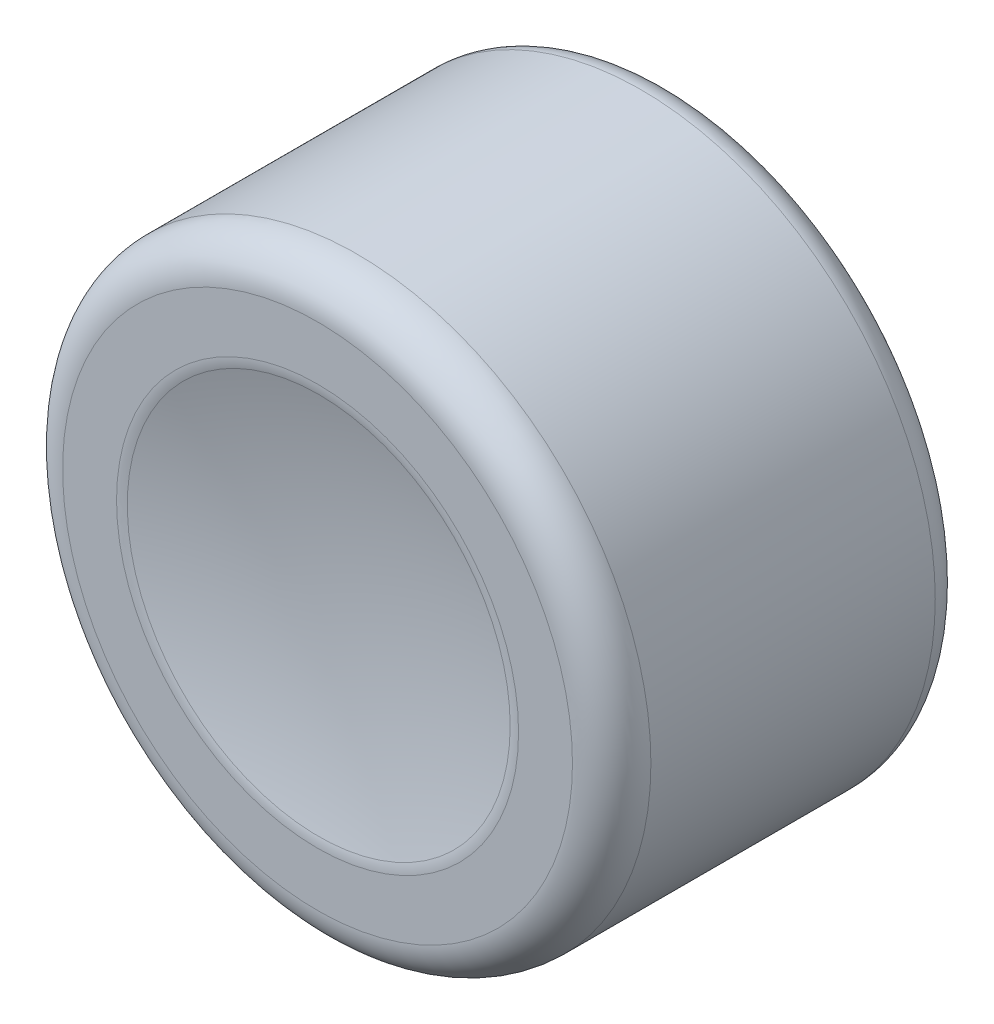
from build123d import *

# Parameters (mm, degrees)
ESQUISSE1_R          = 15
BASE_EXTRUSION_DEPTH = 18
CONG_1_R             = 2
COQUE1_T             = -2.5
CONG_2_R             = 1.5
CHANFREIN1_SIZE      = 0.5
CONG_3_R             = 1


with BuildPart() as part:
    # Esquisse1 → Base-Extrusion (new body)
    with BuildSketch(Plane.XY):
        Circle(ESQUISSE1_R)
    extrude(amount=BASE_EXTRUSION_DEPTH)

    # Esquisse2 → Enl_vement de mati_re-R_volution1 (revolve, cut)
    with BuildSketch(Plane(origin=(0, 0, 0), x_dir=(0, 0, -1), z_dir=(1, 0, 0)), mode=Mode.PRIVATE) as enl_vement_de_mati_re_r_volution1_sk:
        with BuildLine():
            Line((-18, 10), (-18, 0))
            Line((-18, 0), (-16.729833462, 0))
            ThreePointArc((-16.729833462, 0), (-17.048645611, 5.040171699), (-18, 10))
        make_face()
    revolve(enl_vement_de_mati_re_r_volution1_sk.sketch.rotate(Axis((0, 0, 0), (0, 0, 1)), 270), axis=Axis((0, 0, 0), (0, 0, 1)), mode=Mode.SUBTRACT)

    # Cong_1
    cong_1_edges = [part.edges().sort_by_distance(p)[0] for p in [
        (-15, 0, 18),
        (-10, 0, 18),
    ]]
    fillet(cong_1_edges, radius=CONG_1_R)

    # Coque1
    coque1_openings = [part.faces().sort_by_distance(p)[0] for p in [
        (0, 0, 0),
    ]]
    offset(amount=COQUE1_T, openings=coque1_openings, kind=Kind.INTERSECTION)

    # Cong_2
    cong_2_edges = [part.edges().sort_by_distance(p)[0] for p in [
        (-15, 0, 0),
    ]]
    fillet(cong_2_edges, radius=CONG_2_R)

    # Chanfrein1
    chanfrein1_edges = [part.edges().sort_by_distance(p)[0] for p in [
        (-12.5, 0, 0),
    ]]
    chamfer(chanfrein1_edges, length=CHANFREIN1_SIZE)

    # Cong_3
    cong_3_edges = [part.edges().sort_by_distance(p)[0] for p in [
        (-12.5, 0, 15.5),
        (-10.312654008, 0, 15.5),
    ]]
    fillet(cong_3_edges, radius=CONG_3_R)


solid = part.part
